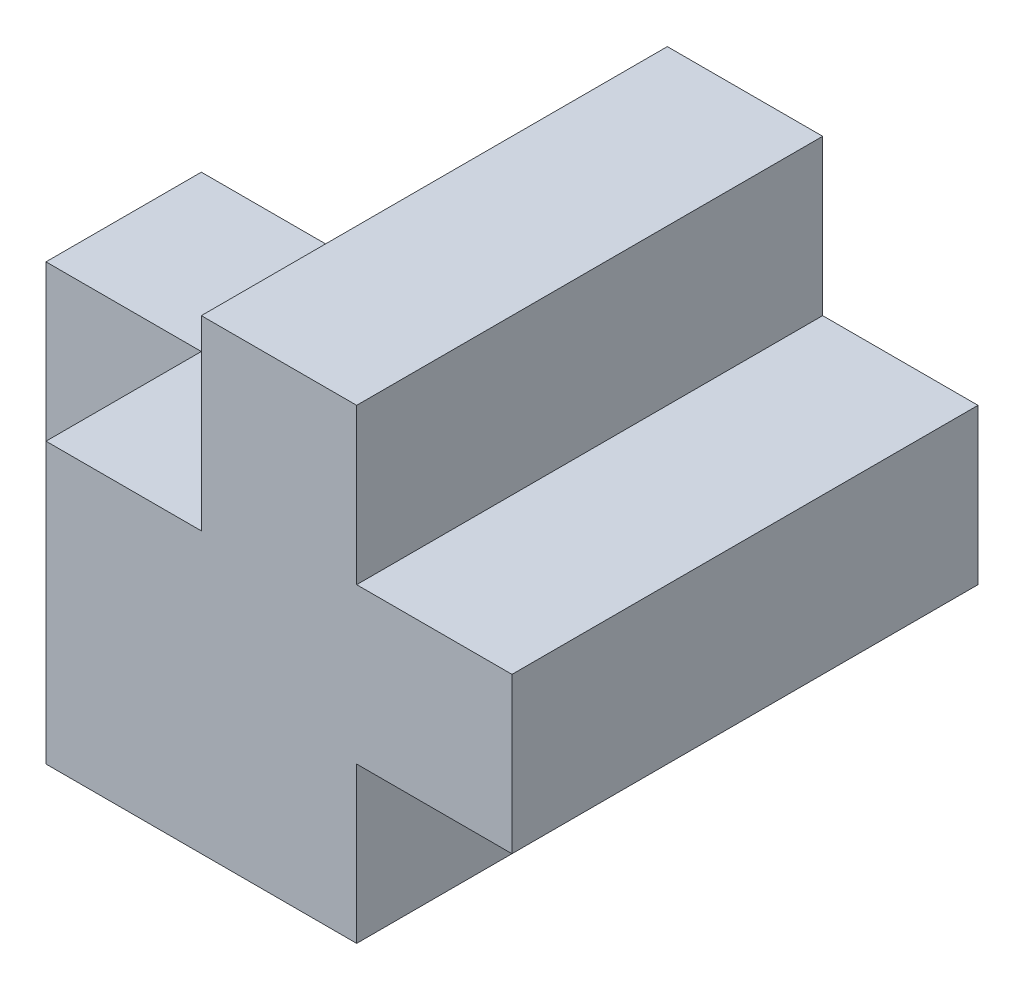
ISO-10303-21;
HEADER;
FILE_DESCRIPTION(('STEP AP214'),'2;1');
FILE_NAME('part.step','',(''),(''),'','','');
FILE_SCHEMA(('AUTOMOTIVE_DESIGN { 1 0 10303 214 1 1 1 1 }'));
ENDSEC;
DATA;
#1=APPLICATION_CONTEXT('core data for automotive mechanical design processes');
#2=APPLICATION_PROTOCOL_DEFINITION('international standard','automotive_design',2000,#1);
#3=PRODUCT_CONTEXT('',#1,'mechanical');
#4=PRODUCT('Part','Part','',(#3));
#5=PRODUCT_RELATED_PRODUCT_CATEGORY('part','',(#4));
#6=PRODUCT_DEFINITION_FORMATION('','',#4);
#7=PRODUCT_DEFINITION_CONTEXT('part definition',#1,'design');
#8=PRODUCT_DEFINITION('design','',#6,#7);
#9=PRODUCT_DEFINITION_SHAPE('','',#8);
#10=(LENGTH_UNIT() NAMED_UNIT(*) SI_UNIT(.MILLI.,.METRE.));
#11=(NAMED_UNIT(*) PLANE_ANGLE_UNIT() SI_UNIT($,.RADIAN.));
#12=(NAMED_UNIT(*) SI_UNIT($,.STERADIAN.) SOLID_ANGLE_UNIT());
#13=UNCERTAINTY_MEASURE_WITH_UNIT(LENGTH_MEASURE(1.E-05),#10,'distance_accuracy_value','');
#14=(GEOMETRIC_REPRESENTATION_CONTEXT(3) GLOBAL_UNCERTAINTY_ASSIGNED_CONTEXT((#13)) GLOBAL_UNIT_ASSIGNED_CONTEXT((#10,
#11,#12)) REPRESENTATION_CONTEXT('',''));
#15=CARTESIAN_POINT('',(0.,0.,0.));
#16=DIRECTION('',(0.,0.,1.));
#17=DIRECTION('',(1.,0.,0.));
#18=AXIS2_PLACEMENT_3D('',#15,#16,#17);
#19=CARTESIAN_POINT('',(0.,0.,-90.));
#20=DIRECTION('',(-1.,0.,0.));
#21=DIRECTION('',(0.,0.,1.));
#22=AXIS2_PLACEMENT_3D('',#19,#20,#21);
#23=PLANE('',#22);
#24=DIRECTION('',(0.,-1.,0.));
#25=VECTOR('',#24,1.);
#26=CARTESIAN_POINT('',(0.,-75.,-90.));
#27=LINE('',#26,#25);
#28=CARTESIAN_POINT('',(0.,75.,-90.));
#29=VERTEX_POINT('',#28);
#30=CARTESIAN_POINT('',(0.,15.,-90.));
#31=VERTEX_POINT('',#30);
#32=EDGE_CURVE('E49',#29,#31,#27,.T.);
#33=ORIENTED_EDGE('',*,*,#32,.T.);
#34=DIRECTION('',(0.,0.,1.));
#35=VECTOR('',#34,1.);
#36=CARTESIAN_POINT('',(0.,15.,60.));
#37=LINE('',#36,#35);
#38=CARTESIAN_POINT('',(0.,15.,60.));
#39=VERTEX_POINT('',#38);
#40=EDGE_CURVE('E35',#31,#39,#37,.T.);
#41=ORIENTED_EDGE('',*,*,#40,.T.);
#42=DIRECTION('',(0.,-1.,0.));
#43=VECTOR('',#42,1.);
#44=CARTESIAN_POINT('',(0.,-75.,60.));
#45=LINE('',#44,#43);
#46=CARTESIAN_POINT('',(0.,75.,60.));
#47=VERTEX_POINT('',#46);
#48=EDGE_CURVE('E149',#47,#39,#45,.T.);
#49=ORIENTED_EDGE('',*,*,#48,.F.);
#50=DIRECTION('',(0.,0.,1.));
#51=VECTOR('',#50,1.);
#52=CARTESIAN_POINT('',(0.,75.,-90.));
#53=LINE('',#52,#51);
#54=EDGE_CURVE('E11',#29,#47,#53,.T.);
#55=ORIENTED_EDGE('',*,*,#54,.F.);
#56=EDGE_LOOP('',(#33,#41,#49,#55));
#57=FACE_BOUND('',#56,.T.);
#58=ADVANCED_FACE('F31',(#57),#23,.T.);
#59=CARTESIAN_POINT('',(0.,75.,-90.));
#60=DIRECTION('',(0.,1.,0.));
#61=DIRECTION('',(0.,0.,1.));
#62=AXIS2_PLACEMENT_3D('',#59,#60,#61);
#63=PLANE('',#62);
#64=ORIENTED_EDGE('',*,*,#54,.T.);
#65=DIRECTION('',(-1.,0.,0.));
#66=VECTOR('',#65,1.);
#67=CARTESIAN_POINT('',(0.,75.,60.));
#68=LINE('',#67,#66);
#69=CARTESIAN_POINT('',(50.,75.,60.));
#70=VERTEX_POINT('',#69);
#71=EDGE_CURVE('E144',#70,#47,#68,.T.);
#72=ORIENTED_EDGE('',*,*,#71,.F.);
#73=DIRECTION('',(0.,0.,1.));
#74=VECTOR('',#73,1.);
#75=CARTESIAN_POINT('',(50.,75.,-90.));
#76=LINE('',#75,#74);
#77=CARTESIAN_POINT('',(50.,75.,-90.));
#78=VERTEX_POINT('',#77);
#79=EDGE_CURVE('E41',#78,#70,#76,.T.);
#80=ORIENTED_EDGE('',*,*,#79,.F.);
#81=DIRECTION('',(-1.,0.,0.));
#82=VECTOR('',#81,1.);
#83=CARTESIAN_POINT('',(0.,75.,-90.));
#84=LINE('',#83,#82);
#85=EDGE_CURVE('E235',#78,#29,#84,.T.);
#86=ORIENTED_EDGE('',*,*,#85,.T.);
#87=EDGE_LOOP('',(#64,#72,#80,#86));
#88=FACE_BOUND('',#87,.T.);
#89=ADVANCED_FACE('F145',(#88),#63,.T.);
#90=CARTESIAN_POINT('',(50.,75.,-90.));
#91=DIRECTION('',(1.,0.,0.));
#92=DIRECTION('',(0.,1.,0.));
#93=AXIS2_PLACEMENT_3D('',#90,#91,#92);
#94=PLANE('',#93);
#95=ORIENTED_EDGE('',*,*,#79,.T.);
#96=DIRECTION('',(0.,1.,0.));
#97=VECTOR('',#96,1.);
#98=CARTESIAN_POINT('',(50.,75.,60.));
#99=LINE('',#98,#97);
#100=CARTESIAN_POINT('',(50.,25.,60.));
#101=VERTEX_POINT('',#100);
#102=EDGE_CURVE('E137',#101,#70,#99,.T.);
#103=ORIENTED_EDGE('',*,*,#102,.F.);
#104=DIRECTION('',(0.,0.,1.));
#105=VECTOR('',#104,1.);
#106=CARTESIAN_POINT('',(50.,25.,-90.));
#107=LINE('',#106,#105);
#108=CARTESIAN_POINT('',(50.,25.,-90.));
#109=VERTEX_POINT('',#108);
#110=EDGE_CURVE('E141',#109,#101,#107,.T.);
#111=ORIENTED_EDGE('',*,*,#110,.F.);
#112=DIRECTION('',(0.,1.,0.));
#113=VECTOR('',#112,1.);
#114=CARTESIAN_POINT('',(50.,75.,-90.));
#115=LINE('',#114,#113);
#116=EDGE_CURVE('E140',#109,#78,#115,.T.);
#117=ORIENTED_EDGE('',*,*,#116,.T.);
#118=EDGE_LOOP('',(#95,#103,#111,#117));
#119=FACE_BOUND('',#118,.T.);
#120=ADVANCED_FACE('F135',(#119),#94,.T.);
#121=CARTESIAN_POINT('',(50.,25.,-90.));
#122=DIRECTION('',(0.,1.,0.));
#123=DIRECTION('',(0.,0.,1.));
#124=AXIS2_PLACEMENT_3D('',#121,#122,#123);
#125=PLANE('',#124);
#126=ORIENTED_EDGE('',*,*,#110,.T.);
#127=DIRECTION('',(-1.,0.,0.));
#128=VECTOR('',#127,1.);
#129=CARTESIAN_POINT('',(50.,25.,60.));
#130=LINE('',#129,#128);
#131=CARTESIAN_POINT('',(100.,25.,60.));
#132=VERTEX_POINT('',#131);
#133=EDGE_CURVE('E155',#132,#101,#130,.T.);
#134=ORIENTED_EDGE('',*,*,#133,.F.);
#135=DIRECTION('',(0.,0.,1.));
#136=VECTOR('',#135,1.);
#137=CARTESIAN_POINT('',(100.,25.,-90.));
#138=LINE('',#137,#136);
#139=CARTESIAN_POINT('',(100.,25.,-90.));
#140=VERTEX_POINT('',#139);
#141=EDGE_CURVE('E243',#140,#132,#138,.T.);
#142=ORIENTED_EDGE('',*,*,#141,.F.);
#143=DIRECTION('',(-1.,0.,0.));
#144=VECTOR('',#143,1.);
#145=CARTESIAN_POINT('',(50.,25.,-90.));
#146=LINE('',#145,#144);
#147=EDGE_CURVE('E238',#140,#109,#146,.T.);
#148=ORIENTED_EDGE('',*,*,#147,.T.);
#149=EDGE_LOOP('',(#126,#134,#142,#148));
#150=FACE_BOUND('',#149,.T.);
#151=ADVANCED_FACE('F270',(#150),#125,.T.);
#152=CARTESIAN_POINT('',(100.,25.,-90.));
#153=DIRECTION('',(1.,0.,0.));
#154=DIRECTION('',(0.,0.,-1.));
#155=AXIS2_PLACEMENT_3D('',#152,#153,#154);
#156=PLANE('',#155);
#157=ORIENTED_EDGE('',*,*,#141,.T.);
#158=DIRECTION('',(0.,1.,0.));
#159=VECTOR('',#158,1.);
#160=CARTESIAN_POINT('',(100.,25.,60.));
#161=LINE('',#160,#159);
#162=CARTESIAN_POINT('',(100.,-25.,60.));
#163=VERTEX_POINT('',#162);
#164=EDGE_CURVE('E161',#163,#132,#161,.T.);
#165=ORIENTED_EDGE('',*,*,#164,.F.);
#166=DIRECTION('',(0.,0.,1.));
#167=VECTOR('',#166,1.);
#168=CARTESIAN_POINT('',(100.,-25.,-90.));
#169=LINE('',#168,#167);
#170=CARTESIAN_POINT('',(100.,-25.,-90.));
#171=VERTEX_POINT('',#170);
#172=EDGE_CURVE('E245',#171,#163,#169,.T.);
#173=ORIENTED_EDGE('',*,*,#172,.F.);
#174=DIRECTION('',(0.,1.,0.));
#175=VECTOR('',#174,1.);
#176=CARTESIAN_POINT('',(100.,25.,-90.));
#177=LINE('',#176,#175);
#178=EDGE_CURVE('E263',#171,#140,#177,.T.);
#179=ORIENTED_EDGE('',*,*,#178,.T.);
#180=EDGE_LOOP('',(#157,#165,#173,#179));
#181=FACE_BOUND('',#180,.T.);
#182=ADVANCED_FACE('F272',(#181),#156,.T.);
#183=CARTESIAN_POINT('',(100.,-25.,-90.));
#184=DIRECTION('',(0.,-1.,0.));
#185=DIRECTION('',(1.,0.,0.));
#186=AXIS2_PLACEMENT_3D('',#183,#184,#185);
#187=PLANE('',#186);
#188=ORIENTED_EDGE('',*,*,#172,.T.);
#189=DIRECTION('',(1.,0.,0.));
#190=VECTOR('',#189,1.);
#191=CARTESIAN_POINT('',(100.,-25.,60.));
#192=LINE('',#191,#190);
#193=CARTESIAN_POINT('',(50.,-25.,60.));
#194=VERTEX_POINT('',#193);
#195=EDGE_CURVE('E165',#194,#163,#192,.T.);
#196=ORIENTED_EDGE('',*,*,#195,.F.);
#197=DIRECTION('',(0.,0.,1.));
#198=VECTOR('',#197,1.);
#199=CARTESIAN_POINT('',(50.,-25.,-90.));
#200=LINE('',#199,#198);
#201=CARTESIAN_POINT('',(50.,-25.,-90.));
#202=VERTEX_POINT('',#201);
#203=EDGE_CURVE('E237',#202,#194,#200,.T.);
#204=ORIENTED_EDGE('',*,*,#203,.F.);
#205=DIRECTION('',(1.,0.,0.));
#206=VECTOR('',#205,1.);
#207=CARTESIAN_POINT('',(100.,-25.,-90.));
#208=LINE('',#207,#206);
#209=EDGE_CURVE('E262',#202,#171,#208,.T.);
#210=ORIENTED_EDGE('',*,*,#209,.T.);
#211=EDGE_LOOP('',(#188,#196,#204,#210));
#212=FACE_BOUND('',#211,.T.);
#213=ADVANCED_FACE('F256',(#212),#187,.T.);
#214=CARTESIAN_POINT('',(50.,-25.,-90.));
#215=DIRECTION('',(1.,0.,0.));
#216=DIRECTION('',(0.,1.,0.));
#217=AXIS2_PLACEMENT_3D('',#214,#215,#216);
#218=PLANE('',#217);
#219=ORIENTED_EDGE('',*,*,#203,.T.);
#220=DIRECTION('',(0.,1.,0.));
#221=VECTOR('',#220,1.);
#222=CARTESIAN_POINT('',(50.,-25.,60.));
#223=LINE('',#222,#221);
#224=CARTESIAN_POINT('',(50.,-75.,60.));
#225=VERTEX_POINT('',#224);
#226=EDGE_CURVE('E168',#225,#194,#223,.T.);
#227=ORIENTED_EDGE('',*,*,#226,.F.);
#228=DIRECTION('',(0.,0.,1.));
#229=VECTOR('',#228,1.);
#230=CARTESIAN_POINT('',(50.,-75.,-90.));
#231=LINE('',#230,#229);
#232=CARTESIAN_POINT('',(50.,-75.,-90.));
#233=VERTEX_POINT('',#232);
#234=EDGE_CURVE('E226',#233,#225,#231,.T.);
#235=ORIENTED_EDGE('',*,*,#234,.F.);
#236=DIRECTION('',(0.,1.,0.));
#237=VECTOR('',#236,1.);
#238=CARTESIAN_POINT('',(50.,-25.,-90.));
#239=LINE('',#238,#237);
#240=EDGE_CURVE('E252',#233,#202,#239,.T.);
#241=ORIENTED_EDGE('',*,*,#240,.T.);
#242=EDGE_LOOP('',(#219,#227,#235,#241));
#243=FACE_BOUND('',#242,.T.);
#244=ADVANCED_FACE('F250',(#243),#218,.T.);
#245=CARTESIAN_POINT('',(50.,-75.,-90.));
#246=DIRECTION('',(0.,-1.,0.));
#247=DIRECTION('',(0.,0.,-1.));
#248=AXIS2_PLACEMENT_3D('',#245,#246,#247);
#249=PLANE('',#248);
#250=ORIENTED_EDGE('',*,*,#234,.T.);
#251=DIRECTION('',(-1.,0.,0.));
#252=VECTOR('',#251,1.);
#253=CARTESIAN_POINT('',(-50.,-75.,60.));
#254=LINE('',#253,#252);
#255=CARTESIAN_POINT('',(-50.,-75.,60.));
#256=VERTEX_POINT('',#255);
#257=EDGE_CURVE('E156',#225,#256,#254,.T.);
#258=ORIENTED_EDGE('',*,*,#257,.T.);
#259=DIRECTION('',(0.,0.,-1.));
#260=VECTOR('',#259,1.);
#261=CARTESIAN_POINT('',(-50.,-75.,10.));
#262=LINE('',#261,#260);
#263=CARTESIAN_POINT('',(-50.,-75.,10.));
#264=VERTEX_POINT('',#263);
#265=EDGE_CURVE('E159',#256,#264,#262,.T.);
#266=ORIENTED_EDGE('',*,*,#265,.T.);
#267=DIRECTION('',(-1.,0.,0.));
#268=VECTOR('',#267,1.);
#269=CARTESIAN_POINT('',(-100.,-75.,10.));
#270=LINE('',#269,#268);
#271=CARTESIAN_POINT('',(-100.,-75.,10.));
#272=VERTEX_POINT('',#271);
#273=EDGE_CURVE('E194',#264,#272,#270,.T.);
#274=ORIENTED_EDGE('',*,*,#273,.T.);
#275=DIRECTION('',(0.,0.,-1.));
#276=VECTOR('',#275,1.);
#277=CARTESIAN_POINT('',(-100.,-75.,-40.));
#278=LINE('',#277,#276);
#279=CARTESIAN_POINT('',(-100.,-75.,-40.));
#280=VERTEX_POINT('',#279);
#281=EDGE_CURVE('E197',#272,#280,#278,.T.);
#282=ORIENTED_EDGE('',*,*,#281,.T.);
#283=DIRECTION('',(1.,0.,0.));
#284=VECTOR('',#283,1.);
#285=CARTESIAN_POINT('',(-50.,-75.,-40.));
#286=LINE('',#285,#284);
#287=CARTESIAN_POINT('',(-50.,-75.,-40.));
#288=VERTEX_POINT('',#287);
#289=EDGE_CURVE('E200',#280,#288,#286,.T.);
#290=ORIENTED_EDGE('',*,*,#289,.T.);
#291=DIRECTION('',(0.,0.,-1.));
#292=VECTOR('',#291,1.);
#293=CARTESIAN_POINT('',(-50.,-75.,-90.));
#294=LINE('',#293,#292);
#295=CARTESIAN_POINT('',(-50.,-75.,-90.));
#296=VERTEX_POINT('',#295);
#297=EDGE_CURVE('E203',#288,#296,#294,.T.);
#298=ORIENTED_EDGE('',*,*,#297,.T.);
#299=DIRECTION('',(1.,0.,0.));
#300=VECTOR('',#299,1.);
#301=CARTESIAN_POINT('',(50.,-75.,-90.));
#302=LINE('',#301,#300);
#303=EDGE_CURVE('E221',#296,#233,#302,.T.);
#304=ORIENTED_EDGE('',*,*,#303,.T.);
#305=EDGE_LOOP('',(#250,#258,#266,#274,#282,#290,#298,#304));
#306=FACE_BOUND('',#305,.T.);
#307=ADVANCED_FACE('F33',(#306),#249,.T.);
#308=CARTESIAN_POINT('',(0.,75.,-90.));
#309=DIRECTION('',(0.,0.,-1.));
#310=DIRECTION('',(-1.,0.,0.));
#311=AXIS2_PLACEMENT_3D('',#308,#309,#310);
#312=PLANE('',#311);
#313=ORIENTED_EDGE('',*,*,#32,.F.);
#314=ORIENTED_EDGE('',*,*,#85,.F.);
#315=ORIENTED_EDGE('',*,*,#116,.F.);
#316=ORIENTED_EDGE('',*,*,#147,.F.);
#317=ORIENTED_EDGE('',*,*,#178,.F.);
#318=ORIENTED_EDGE('',*,*,#209,.F.);
#319=ORIENTED_EDGE('',*,*,#240,.F.);
#320=ORIENTED_EDGE('',*,*,#303,.F.);
#321=DIRECTION('',(0.,-1.,0.));
#322=VECTOR('',#321,1.);
#323=CARTESIAN_POINT('',(-50.,15.,-90.));
#324=LINE('',#323,#322);
#325=CARTESIAN_POINT('',(-50.,15.,-90.));
#326=VERTEX_POINT('',#325);
#327=EDGE_CURVE('E206',#326,#296,#324,.T.);
#328=ORIENTED_EDGE('',*,*,#327,.F.);
#329=DIRECTION('',(1.,0.,0.));
#330=VECTOR('',#329,1.);
#331=CARTESIAN_POINT('',(0.,15.,-90.));
#332=LINE('',#331,#330);
#333=EDGE_CURVE('E190',#326,#31,#332,.T.);
#334=ORIENTED_EDGE('',*,*,#333,.T.);
#335=EDGE_LOOP('',(#313,#314,#315,#316,#317,#318,#319,#320,#328,#334));
#336=FACE_BOUND('',#335,.T.);
#337=ADVANCED_FACE('F230',(#336),#312,.T.);
#338=CARTESIAN_POINT('',(-50.,15.,-90.));
#339=DIRECTION('',(-1.,0.,0.));
#340=DIRECTION('',(0.,0.,1.));
#341=AXIS2_PLACEMENT_3D('',#338,#339,#340);
#342=PLANE('',#341);
#343=ORIENTED_EDGE('',*,*,#297,.F.);
#344=DIRECTION('',(0.,-1.,0.));
#345=VECTOR('',#344,1.);
#346=CARTESIAN_POINT('',(-50.,15.,-40.));
#347=LINE('',#346,#345);
#348=CARTESIAN_POINT('',(-50.,15.,-40.));
#349=VERTEX_POINT('',#348);
#350=EDGE_CURVE('E209',#349,#288,#347,.T.);
#351=ORIENTED_EDGE('',*,*,#350,.F.);
#352=DIRECTION('',(0.,0.,-1.));
#353=VECTOR('',#352,1.);
#354=CARTESIAN_POINT('',(-50.,15.,-90.));
#355=LINE('',#354,#353);
#356=EDGE_CURVE('E188',#349,#326,#355,.T.);
#357=ORIENTED_EDGE('',*,*,#356,.T.);
#358=ORIENTED_EDGE('',*,*,#327,.T.);
#359=EDGE_LOOP('',(#343,#351,#357,#358));
#360=FACE_BOUND('',#359,.T.);
#361=ADVANCED_FACE('F393',(#360),#342,.T.);
#362=CARTESIAN_POINT('',(-50.,15.,-40.));
#363=DIRECTION('',(0.,0.,-1.));
#364=DIRECTION('',(-1.,0.,0.));
#365=AXIS2_PLACEMENT_3D('',#362,#363,#364);
#366=PLANE('',#365);
#367=ORIENTED_EDGE('',*,*,#289,.F.);
#368=DIRECTION('',(0.,-1.,0.));
#369=VECTOR('',#368,1.);
#370=CARTESIAN_POINT('',(-100.,15.,-40.));
#371=LINE('',#370,#369);
#372=CARTESIAN_POINT('',(-100.,15.,-40.));
#373=VERTEX_POINT('',#372);
#374=EDGE_CURVE('E211',#373,#280,#371,.T.);
#375=ORIENTED_EDGE('',*,*,#374,.F.);
#376=DIRECTION('',(1.,0.,0.));
#377=VECTOR('',#376,1.);
#378=CARTESIAN_POINT('',(-50.,15.,-40.));
#379=LINE('',#378,#377);
#380=EDGE_CURVE('E185',#373,#349,#379,.T.);
#381=ORIENTED_EDGE('',*,*,#380,.T.);
#382=ORIENTED_EDGE('',*,*,#350,.T.);
#383=EDGE_LOOP('',(#367,#375,#381,#382));
#384=FACE_BOUND('',#383,.T.);
#385=ADVANCED_FACE('F406',(#384),#366,.T.);
#386=CARTESIAN_POINT('',(-100.,15.,-40.));
#387=DIRECTION('',(-1.,0.,0.));
#388=DIRECTION('',(0.,0.,1.));
#389=AXIS2_PLACEMENT_3D('',#386,#387,#388);
#390=PLANE('',#389);
#391=ORIENTED_EDGE('',*,*,#281,.F.);
#392=DIRECTION('',(0.,-1.,0.));
#393=VECTOR('',#392,1.);
#394=CARTESIAN_POINT('',(-100.,15.,10.));
#395=LINE('',#394,#393);
#396=CARTESIAN_POINT('',(-100.,15.,10.));
#397=VERTEX_POINT('',#396);
#398=EDGE_CURVE('E213',#397,#272,#395,.T.);
#399=ORIENTED_EDGE('',*,*,#398,.F.);
#400=DIRECTION('',(0.,0.,-1.));
#401=VECTOR('',#400,1.);
#402=CARTESIAN_POINT('',(-100.,15.,-40.));
#403=LINE('',#402,#401);
#404=EDGE_CURVE('E182',#397,#373,#403,.T.);
#405=ORIENTED_EDGE('',*,*,#404,.T.);
#406=ORIENTED_EDGE('',*,*,#374,.T.);
#407=EDGE_LOOP('',(#391,#399,#405,#406));
#408=FACE_BOUND('',#407,.T.);
#409=ADVANCED_FACE('F415',(#408),#390,.T.);
#410=CARTESIAN_POINT('',(-100.,15.,10.));
#411=DIRECTION('',(0.,0.,1.));
#412=DIRECTION('',(1.,0.,0.));
#413=AXIS2_PLACEMENT_3D('',#410,#411,#412);
#414=PLANE('',#413);
#415=ORIENTED_EDGE('',*,*,#273,.F.);
#416=DIRECTION('',(0.,-1.,0.));
#417=VECTOR('',#416,1.);
#418=CARTESIAN_POINT('',(-50.,15.,10.));
#419=LINE('',#418,#417);
#420=CARTESIAN_POINT('',(-50.,15.,10.));
#421=VERTEX_POINT('',#420);
#422=EDGE_CURVE('E215',#421,#264,#419,.T.);
#423=ORIENTED_EDGE('',*,*,#422,.F.);
#424=DIRECTION('',(-1.,0.,0.));
#425=VECTOR('',#424,1.);
#426=CARTESIAN_POINT('',(-100.,15.,10.));
#427=LINE('',#426,#425);
#428=EDGE_CURVE('E179',#421,#397,#427,.T.);
#429=ORIENTED_EDGE('',*,*,#428,.T.);
#430=ORIENTED_EDGE('',*,*,#398,.T.);
#431=EDGE_LOOP('',(#415,#423,#429,#430));
#432=FACE_BOUND('',#431,.T.);
#433=ADVANCED_FACE('F424',(#432),#414,.T.);
#434=CARTESIAN_POINT('',(-50.,15.,10.));
#435=DIRECTION('',(-1.,0.,0.));
#436=DIRECTION('',(0.,0.,1.));
#437=AXIS2_PLACEMENT_3D('',#434,#435,#436);
#438=PLANE('',#437);
#439=ORIENTED_EDGE('',*,*,#265,.F.);
#440=DIRECTION('',(0.,-1.,0.));
#441=VECTOR('',#440,1.);
#442=CARTESIAN_POINT('',(-50.,15.,60.));
#443=LINE('',#442,#441);
#444=CARTESIAN_POINT('',(-50.,15.,60.));
#445=VERTEX_POINT('',#444);
#446=EDGE_CURVE('E217',#445,#256,#443,.T.);
#447=ORIENTED_EDGE('',*,*,#446,.F.);
#448=DIRECTION('',(0.,0.,-1.));
#449=VECTOR('',#448,1.);
#450=CARTESIAN_POINT('',(-50.,15.,10.));
#451=LINE('',#450,#449);
#452=EDGE_CURVE('E176',#445,#421,#451,.T.);
#453=ORIENTED_EDGE('',*,*,#452,.T.);
#454=ORIENTED_EDGE('',*,*,#422,.T.);
#455=EDGE_LOOP('',(#439,#447,#453,#454));
#456=FACE_BOUND('',#455,.T.);
#457=ADVANCED_FACE('F339',(#456),#438,.T.);
#458=CARTESIAN_POINT('',(-50.,15.,60.));
#459=DIRECTION('',(0.,0.,1.));
#460=DIRECTION('',(1.,0.,0.));
#461=AXIS2_PLACEMENT_3D('',#458,#459,#460);
#462=PLANE('',#461);
#463=ORIENTED_EDGE('',*,*,#257,.F.);
#464=ORIENTED_EDGE('',*,*,#226,.T.);
#465=ORIENTED_EDGE('',*,*,#195,.T.);
#466=ORIENTED_EDGE('',*,*,#164,.T.);
#467=ORIENTED_EDGE('',*,*,#133,.T.);
#468=ORIENTED_EDGE('',*,*,#102,.T.);
#469=ORIENTED_EDGE('',*,*,#71,.T.);
#470=ORIENTED_EDGE('',*,*,#48,.T.);
#471=DIRECTION('',(-1.,0.,0.));
#472=VECTOR('',#471,1.);
#473=CARTESIAN_POINT('',(-50.,15.,60.));
#474=LINE('',#473,#472);
#475=EDGE_CURVE('E173',#39,#445,#474,.T.);
#476=ORIENTED_EDGE('',*,*,#475,.T.);
#477=ORIENTED_EDGE('',*,*,#446,.T.);
#478=EDGE_LOOP('',(#463,#464,#465,#466,#467,#468,#469,#470,#476,#477));
#479=FACE_BOUND('',#478,.T.);
#480=ADVANCED_FACE('F152',(#479),#462,.T.);
#481=CARTESIAN_POINT('',(0.,15.,-90.));
#482=DIRECTION('',(0.,1.,0.));
#483=DIRECTION('',(0.,0.,1.));
#484=AXIS2_PLACEMENT_3D('',#481,#482,#483);
#485=PLANE('',#484);
#486=ORIENTED_EDGE('',*,*,#40,.F.);
#487=ORIENTED_EDGE('',*,*,#333,.F.);
#488=ORIENTED_EDGE('',*,*,#356,.F.);
#489=ORIENTED_EDGE('',*,*,#380,.F.);
#490=ORIENTED_EDGE('',*,*,#404,.F.);
#491=ORIENTED_EDGE('',*,*,#428,.F.);
#492=ORIENTED_EDGE('',*,*,#452,.F.);
#493=ORIENTED_EDGE('',*,*,#475,.F.);
#494=EDGE_LOOP('',(#486,#487,#488,#489,#490,#491,#492,#493));
#495=FACE_BOUND('',#494,.T.);
#496=ADVANCED_FACE('F338',(#495),#485,.T.);
#497=CLOSED_SHELL('',(#58,#89,#120,#151,#182,#213,#244,#307,#337,#361,#385,#409,#433,#457,#480,#496));
#498=MANIFOLD_SOLID_BREP('B2',#497);
#499=ADVANCED_BREP_SHAPE_REPRESENTATION('',(#18,#498),#14);
#500=SHAPE_DEFINITION_REPRESENTATION(#9,#499);
ENDSEC;
END-ISO-10303-21;
